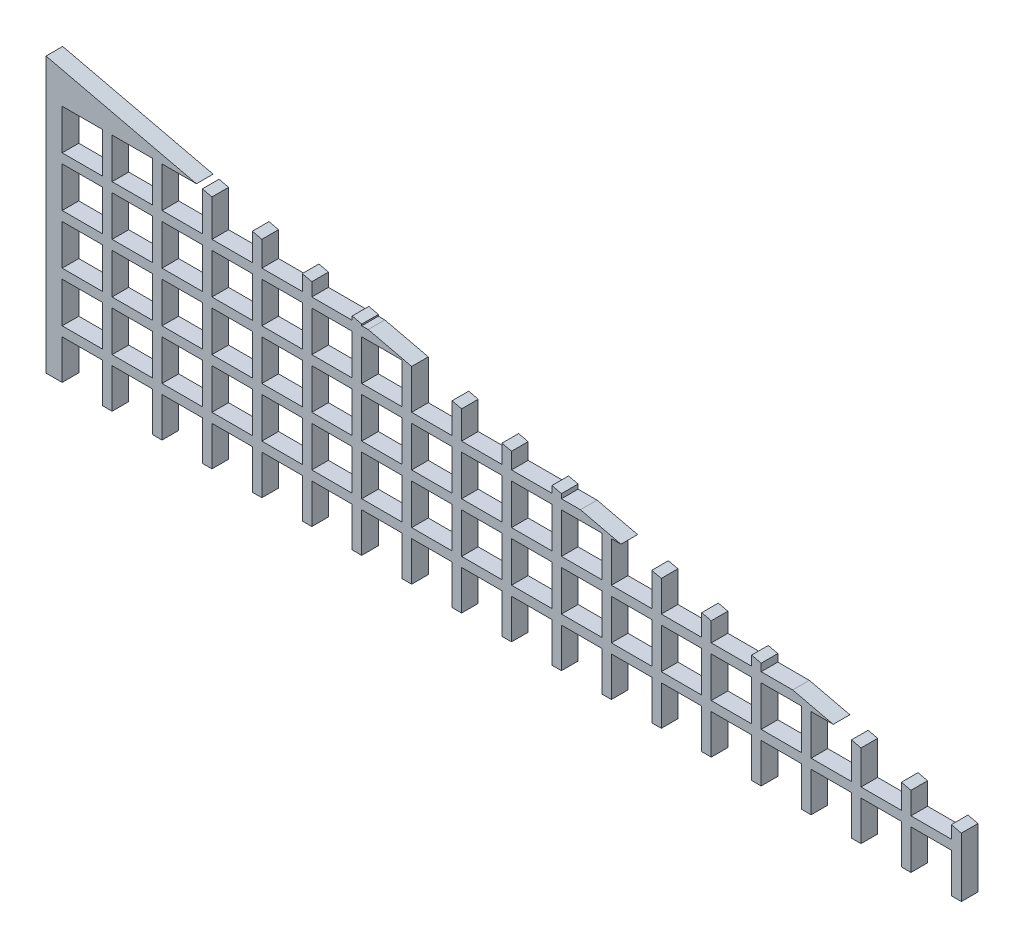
from build123d import *

# Parameters (mm, degrees)
SKETCH1_W           = 6.164472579
SKETCH1_H           = 6.164472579
BOSS_EXTRUDE1_DEPTH = 2.54


with BuildPart() as part:
    # Sketch1 → Boss-Extrude1 (new body)
    with BuildSketch(Plane.XY):
        Polygon((0, 41.91), (0, 0), (2.466630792, 0), (2.466630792, 6.028687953), (8.631103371, 6.028687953), (8.631103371, 0), (10.086630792, 0), (10.086630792, 6.028687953), (16.251103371, 6.028687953), (16.251103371, 0), (17.706630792, 0), (17.706630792, 6.028687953), (23.871103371, 6.028687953), (23.871103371, 0), (25.326630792, 0), (25.326630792, 6.028687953), (31.491103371, 6.028687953), (31.491103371, 0), (32.946630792, 0), (32.946630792, 6.028687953), (39.111103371, 6.028687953), (39.111103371, 0), (40.566630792, 0), (40.566630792, 6.028687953), (46.731103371, 6.028687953), (46.731103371, 0), (48.186630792, 0), (48.186630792, 6.028687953), (54.351103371, 6.028687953), (54.351103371, 0), (55.806630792, 0), (55.806630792, 6.028687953), (61.971103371, 6.028687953), (61.971103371, 0), (63.426630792, 0), (63.426630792, 6.028687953), (69.591103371, 6.028687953), (69.591103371, 0), (71.046630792, 0), (71.046630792, 6.028687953), (77.211103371, 6.028687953), (77.211103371, 0), (78.666630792, 0), (78.666630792, 6.028687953), (84.831103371, 6.028687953), (84.831103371, 0), (86.286630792, 0), (86.286630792, 6.028687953), (92.451103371, 6.028687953), (92.451103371, 0), (93.906630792, 0), (93.906630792, 6.028687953), (100.071103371, 6.028687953), (100.071103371, 0), (101.526630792, 0), (101.526630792, 6.028687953), (107.691103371, 6.028687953), (107.691103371, 0), (109.146630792, 0), (109.146630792, 6.028687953), (115.311103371, 6.028687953), (115.311103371, 0), (116.766630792, 0), (116.766630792, 6.028687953), (122.931103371, 6.028687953), (122.931103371, 0), (124.386630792, 0), (124.386630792, 6.028687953), (130.551103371, 6.028687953), (130.551103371, 0), (132.006630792, 0), (132.006630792, 6.028687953), (138.171103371, 6.028687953), (138.171103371, 0), (139.7, 0), (139.7, 9.048764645), (138.171103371, 9.408402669), (138.171103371, 7.484215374), (132.006630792, 7.484215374), (132.006630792, 10.858454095), (130.551103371, 11.200833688), (130.551103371, 7.484215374), (124.386630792, 7.484215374), (124.386630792, 12.650885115), (122.931103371, 12.993264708), (122.931103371, 7.484215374), (116.766630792, 7.484215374), (116.766630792, 13.648687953), (120.144761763, 13.648687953), (113.957009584, 15.104215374), (109.146630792, 15.104215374), (109.146630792, 16.235747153), (107.691103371, 16.578126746), (107.691103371, 15.104215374), (101.526630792, 15.104215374), (101.526630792, 18.028178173), (100.071103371, 18.370557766), (100.071103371, 15.104215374), (93.906630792, 15.104215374), (93.906630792, 19.820609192), (92.451103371, 20.162988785), (92.451103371, 15.104215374), (86.286630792, 15.104215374), (86.286630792, 21.268687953), (87.750544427, 21.268687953), (81.562792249, 22.724215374), (78.666630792, 22.724215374), (78.666630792, 23.405471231), (77.211103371, 23.747850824), (77.211103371, 22.724215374), (71.046630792, 22.724215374), (71.046630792, 25.19790225), (69.591103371, 25.540281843), (69.591103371, 22.724215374), (63.426630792, 22.724215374), (63.426630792, 26.99033327), (61.971103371, 27.332712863), (61.971103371, 22.724215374), (55.806630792, 22.724215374), (55.806630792, 28.782764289), (49.168574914, 30.344215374), (48.186630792, 30.344215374), (48.186630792, 30.575195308), (46.731103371, 30.917574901), (46.731103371, 30.344215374), (40.566630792, 30.344215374), (40.566630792, 32.367626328), (39.111103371, 32.710005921), (39.111103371, 30.344215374), (32.946630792, 30.344215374), (32.946630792, 34.160057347), (31.491103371, 34.50243694), (31.491103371, 30.344215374), (25.326630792, 30.344215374), (25.326630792, 35.952488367), (23.871103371, 36.294867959), (23.871103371, 30.344215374), (17.706630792, 30.344215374), (17.706630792, 36.508687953), (22.962109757, 36.508687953), align=None)
        with Locations((5.548867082, 10.566451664)):
            Rectangle(SKETCH1_W, SKETCH1_H, mode=Mode.SUBTRACT)
        with Locations((13.168867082, 10.566451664)):
            Rectangle(SKETCH1_W, SKETCH1_H, mode=Mode.SUBTRACT)
        with Locations((20.788867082, 10.566451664)):
            Rectangle(SKETCH1_W, SKETCH1_H, mode=Mode.SUBTRACT)
        with Locations((28.408867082, 10.566451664)):
            Rectangle(SKETCH1_W, SKETCH1_H, mode=Mode.SUBTRACT)
        with Locations((5.548867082, 18.186451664)):
            Rectangle(SKETCH1_W, SKETCH1_H, mode=Mode.SUBTRACT)
        with Locations((13.168867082, 18.186451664)):
            Rectangle(SKETCH1_W, SKETCH1_H, mode=Mode.SUBTRACT)
        with Locations((20.788867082, 18.186451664)):
            Rectangle(SKETCH1_W, SKETCH1_H, mode=Mode.SUBTRACT)
        with Locations((28.408867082, 18.186451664)):
            Rectangle(SKETCH1_W, SKETCH1_H, mode=Mode.SUBTRACT)
        with Locations((36.028867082, 10.566451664)):
            Rectangle(SKETCH1_W, SKETCH1_H, mode=Mode.SUBTRACT)
        with Locations((43.648867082, 10.566451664)):
            Rectangle(SKETCH1_W, SKETCH1_H, mode=Mode.SUBTRACT)
        with Locations((51.268867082, 10.566451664)):
            Rectangle(SKETCH1_W, SKETCH1_H, mode=Mode.SUBTRACT)
        with Locations((58.888867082, 10.566451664)):
            Rectangle(SKETCH1_W, SKETCH1_H, mode=Mode.SUBTRACT)
        with Locations((66.508867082, 10.566451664)):
            Rectangle(SKETCH1_W, SKETCH1_H, mode=Mode.SUBTRACT)
        with Locations((36.028867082, 18.186451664)):
            Rectangle(SKETCH1_W, SKETCH1_H, mode=Mode.SUBTRACT)
        with Locations((43.648867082, 18.186451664)):
            Rectangle(SKETCH1_W, SKETCH1_H, mode=Mode.SUBTRACT)
        with Locations((51.268867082, 18.186451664)):
            Rectangle(SKETCH1_W, SKETCH1_H, mode=Mode.SUBTRACT)
        with Locations((58.888867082, 18.186451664)):
            Rectangle(SKETCH1_W, SKETCH1_H, mode=Mode.SUBTRACT)
        with Locations((66.508867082, 18.186451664)):
            Rectangle(SKETCH1_W, SKETCH1_H, mode=Mode.SUBTRACT)
        with Locations((74.128867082, 10.566451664)):
            Rectangle(SKETCH1_W, SKETCH1_H, mode=Mode.SUBTRACT)
        with Locations((81.748867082, 10.566451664)):
            Rectangle(SKETCH1_W, SKETCH1_H, mode=Mode.SUBTRACT)
        with Locations((89.368867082, 10.566451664)):
            Rectangle(SKETCH1_W, SKETCH1_H, mode=Mode.SUBTRACT)
        with Locations((96.988867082, 10.566451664)):
            Rectangle(SKETCH1_W, SKETCH1_H, mode=Mode.SUBTRACT)
        with Locations((104.608867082, 10.566451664)):
            Rectangle(SKETCH1_W, SKETCH1_H, mode=Mode.SUBTRACT)
        with Locations((74.128867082, 18.186451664)):
            Rectangle(SKETCH1_W, SKETCH1_H, mode=Mode.SUBTRACT)
        with Locations((81.748867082, 18.186451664)):
            Rectangle(SKETCH1_W, SKETCH1_H, mode=Mode.SUBTRACT)
        with Locations((112.228867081, 10.566451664)):
            Rectangle(SKETCH1_W, SKETCH1_H, mode=Mode.SUBTRACT)
        with Locations((5.548867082, 25.806451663)):
            Rectangle(SKETCH1_W, SKETCH1_H, mode=Mode.SUBTRACT)
        with Locations((13.168867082, 25.806451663)):
            Rectangle(SKETCH1_W, SKETCH1_H, mode=Mode.SUBTRACT)
        with Locations((20.788867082, 25.806451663)):
            Rectangle(SKETCH1_W, SKETCH1_H, mode=Mode.SUBTRACT)
        with Locations((28.408867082, 25.806451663)):
            Rectangle(SKETCH1_W, SKETCH1_H, mode=Mode.SUBTRACT)
        with Locations((36.028867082, 25.806451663)):
            Rectangle(SKETCH1_W, SKETCH1_H, mode=Mode.SUBTRACT)
        with Locations((43.648867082, 25.806451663)):
            Rectangle(SKETCH1_W, SKETCH1_H, mode=Mode.SUBTRACT)
        with Locations((51.268867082, 25.806451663)):
            Rectangle(SKETCH1_W, SKETCH1_H, mode=Mode.SUBTRACT)
        with Locations((5.548867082, 33.426451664)):
            Rectangle(SKETCH1_W, SKETCH1_H, mode=Mode.SUBTRACT)
        with Locations((13.168867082, 33.426451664)):
            Rectangle(SKETCH1_W, SKETCH1_H, mode=Mode.SUBTRACT)
    extrude(amount=BOSS_EXTRUDE1_DEPTH)


solid = part.part
